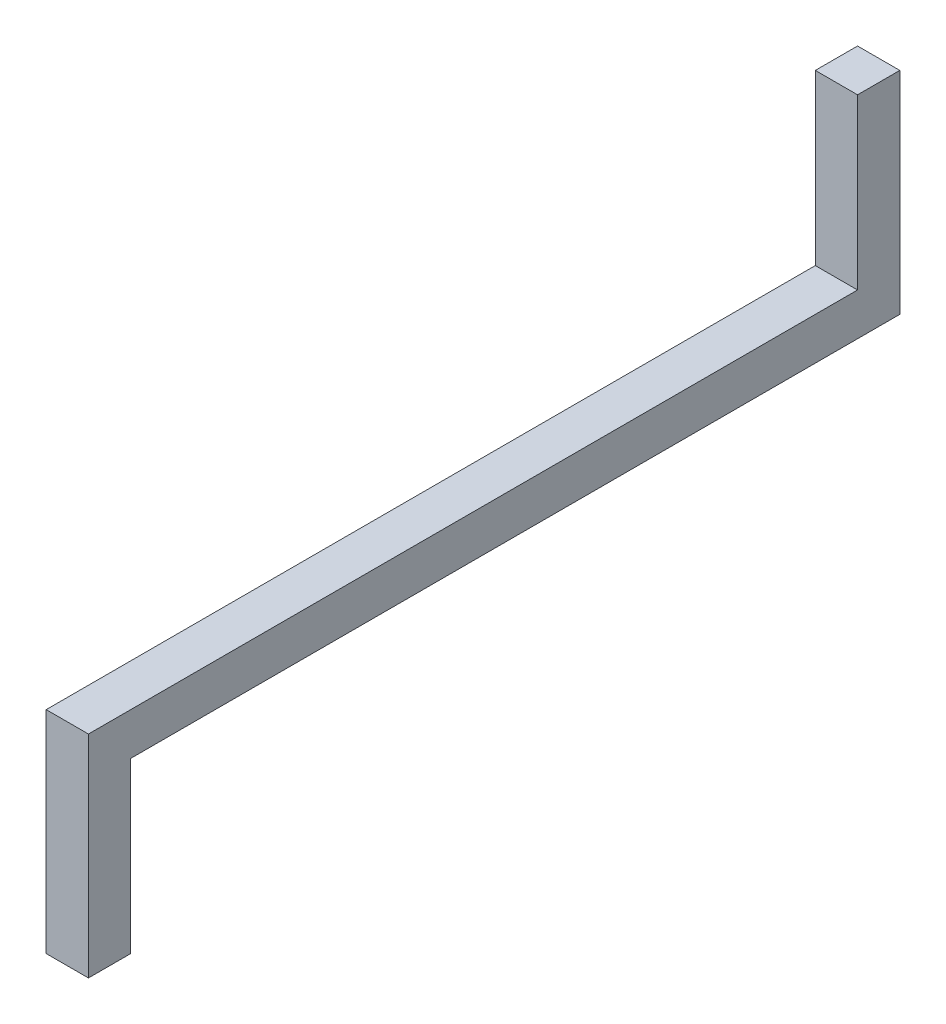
from build123d import *

# Parameters (mm, degrees)
BOSS_EXTRUDE1_DEPTH = 3.175


with BuildPart() as part:
    # Sketch1 → Boss-Extrude1 (new body)
    with BuildSketch(Plane(origin=(0, 0, 0), x_dir=(0, 0, -1), z_dir=(1, 0, 0))):
        Polygon((0, 0), (-3.175, 0), (-3.175, 15.875), (54.61, 15.875), (54.61, 28.575), (57.785, 28.575), (57.785, 19.242513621), (57.785, 15.875), (57.785, 12.7), (0, 12.7), align=None)
    extrude(amount=BOSS_EXTRUDE1_DEPTH)


solid = part.part
